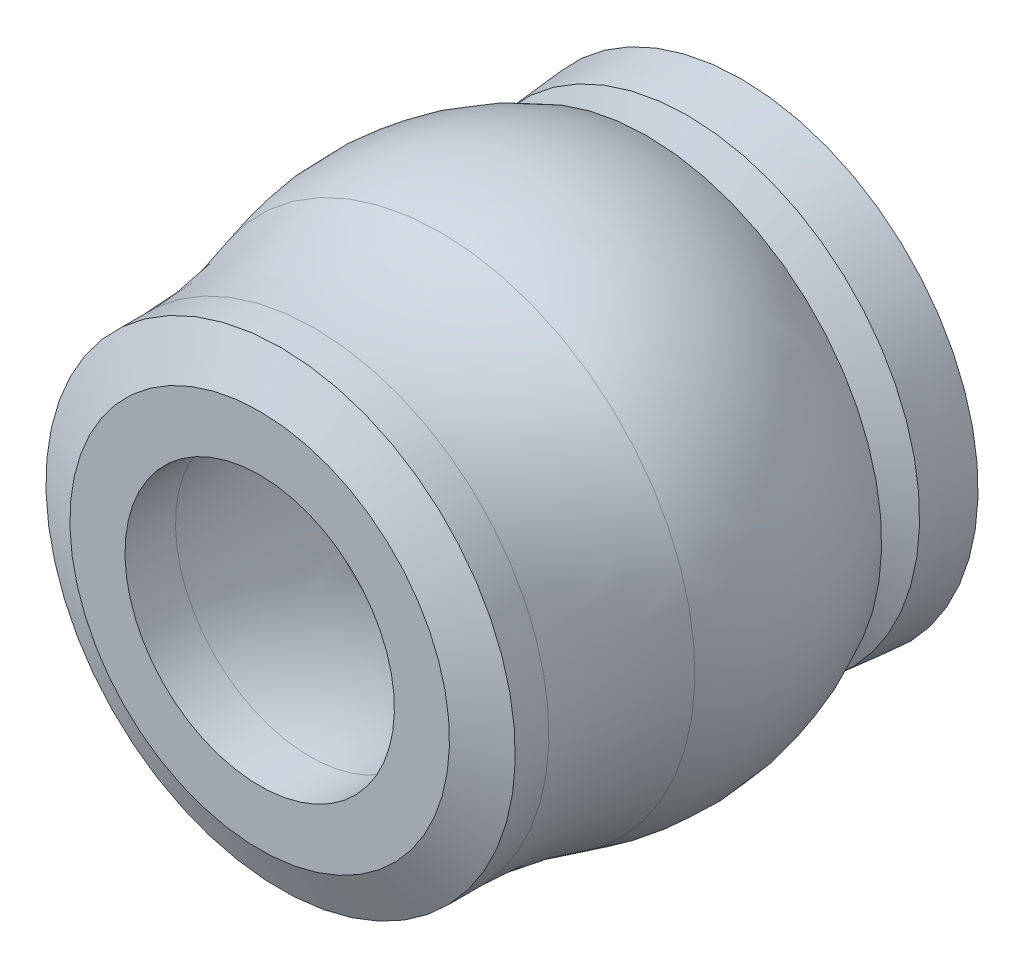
ISO-10303-21;
HEADER;
FILE_DESCRIPTION(('STEP AP214'),'2;1');
FILE_NAME('part.step','',(''),(''),'','','');
FILE_SCHEMA(('AUTOMOTIVE_DESIGN { 1 0 10303 214 1 1 1 1 }'));
ENDSEC;
DATA;
#1=APPLICATION_CONTEXT('core data for automotive mechanical design processes');
#2=APPLICATION_PROTOCOL_DEFINITION('international standard','automotive_design',2000,#1);
#3=PRODUCT_CONTEXT('',#1,'mechanical');
#4=PRODUCT('Part','Part','',(#3));
#5=PRODUCT_RELATED_PRODUCT_CATEGORY('part','',(#4));
#6=PRODUCT_DEFINITION_FORMATION('','',#4);
#7=PRODUCT_DEFINITION_CONTEXT('part definition',#1,'design');
#8=PRODUCT_DEFINITION('design','',#6,#7);
#9=PRODUCT_DEFINITION_SHAPE('','',#8);
#10=(LENGTH_UNIT() NAMED_UNIT(*) SI_UNIT(.MILLI.,.METRE.));
#11=(NAMED_UNIT(*) PLANE_ANGLE_UNIT() SI_UNIT($,.RADIAN.));
#12=(NAMED_UNIT(*) SI_UNIT($,.STERADIAN.) SOLID_ANGLE_UNIT());
#13=UNCERTAINTY_MEASURE_WITH_UNIT(LENGTH_MEASURE(1.E-05),#10,'distance_accuracy_value','');
#14=(GEOMETRIC_REPRESENTATION_CONTEXT(3) GLOBAL_UNCERTAINTY_ASSIGNED_CONTEXT((#13)) GLOBAL_UNIT_ASSIGNED_CONTEXT((#10,
#11,#12)) REPRESENTATION_CONTEXT('',''));
#15=CARTESIAN_POINT('',(0.,0.,0.));
#16=DIRECTION('',(0.,0.,1.));
#17=DIRECTION('',(1.,0.,0.));
#18=AXIS2_PLACEMENT_3D('',#15,#16,#17);
#19=CARTESIAN_POINT('',(0.,0.,7.0294771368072));
#20=DIRECTION('',(0.,0.,-1.));
#21=DIRECTION('',(0.,1.,0.));
#22=AXIS2_PLACEMENT_3D('',#19,#20,#21);
#23=TOROIDAL_SURFACE('',#22,9.398,1.016);
#24=CARTESIAN_POINT('',(0.,0.,7.0294771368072));
#25=DIRECTION('',(0.,0.,-1.));
#26=DIRECTION('',(0.,1.,0.));
#27=AXIS2_PLACEMENT_3D('',#24,#25,#26);
#28=CIRCLE('',#27,8.382);
#29=CARTESIAN_POINT('',(0.,8.382,7.0294771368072));
#30=VERTEX_POINT('',#29);
#31=EDGE_CURVE('E97',#30,#30,#28,.T.);
#32=ORIENTED_EDGE('',*,*,#31,.T.);
#33=EDGE_LOOP('',(#32));
#34=FACE_BOUND('',#33,.T.);
#35=CARTESIAN_POINT('',(0.,0.,7.62364055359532));
#36=DIRECTION('',(0.,0.,-1.));
#37=DIRECTION('',(0.,1.,0.));
#38=AXIS2_PLACEMENT_3D('',#35,#36,#37);
#39=CIRCLE('',#38,8.57384841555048);
#40=CARTESIAN_POINT('',(0.,8.57384841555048,7.62364055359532));
#41=VERTEX_POINT('',#40);
#42=EDGE_CURVE('E158',#41,#41,#39,.F.);
#43=ORIENTED_EDGE('',*,*,#42,.T.);
#44=EDGE_LOOP('',(#43));
#45=FACE_BOUND('',#44,.T.);
#46=ADVANCED_FACE('F12',(#34,#45),#23,.T.);
#47=CARTESIAN_POINT('',(0.,0.12326470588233,13.716));
#48=DIRECTION('',(1.,0.,0.));
#49=DIRECTION('',(0.,1.,0.));
#50=AXIS2_PLACEMENT_3D('',#47,#48,#49);
#51=CIRCLE('',#50,10.4177352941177);
#52=TRIMMED_CURVE('',#51,(PARAMETER_VALUE(-1.5826288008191)),(PARAMETER_VALUE(1.5826288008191)),
.T.,.PARAMETER.);
#53=CARTESIAN_POINT('',(0.,0.,13.716));
#54=DIRECTION('',(0.,0.,-1.));
#55=AXIS1_PLACEMENT('',#53,#54);
#56=SURFACE_OF_REVOLUTION('',#52,#55);
#57=ORIENTED_EDGE('',*,*,#42,.F.);
#58=EDGE_LOOP('',(#57));
#59=FACE_BOUND('',#58,.T.);
#60=CARTESIAN_POINT('',(0.,0.,17.0560762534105));
#61=DIRECTION('',(0.,0.,-1.));
#62=DIRECTION('',(0.,1.,0.));
#63=AXIS2_PLACEMENT_3D('',#60,#61,#62);
#64=CIRCLE('',#63,9.99104557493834);
#65=CARTESIAN_POINT('',(0.,9.99104557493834,17.0560762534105));
#66=VERTEX_POINT('',#65);
#67=EDGE_CURVE('E94',#66,#66,#64,.T.);
#68=ORIENTED_EDGE('',*,*,#67,.F.);
#69=EDGE_LOOP('',(#68));
#70=FACE_BOUND('',#69,.T.);
#71=ADVANCED_FACE('F101',(#59,#70),#56,.T.);
#72=CARTESIAN_POINT('',(0.,0.,-5.86541473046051));
#73=DIRECTION('',(0.,0.,-1.));
#74=DIRECTION('',(0.,1.,0.));
#75=AXIS2_PLACEMENT_3D('',#72,#73,#74);
#76=CYLINDRICAL_SURFACE('',#75,8.382);
#77=CARTESIAN_POINT('',(0.,0.,6.89873754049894));
#78=DIRECTION('',(0.,0.,1.));
#79=DIRECTION('',(0.,-1.,0.));
#80=AXIS2_PLACEMENT_3D('',#77,#78,#79);
#81=CIRCLE('',#80,8.382);
#82=CARTESIAN_POINT('',(0.,-8.382,6.89873754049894));
#83=VERTEX_POINT('',#82);
#84=EDGE_CURVE('E91',#83,#83,#81,.F.);
#85=ORIENTED_EDGE('',*,*,#84,.T.);
#86=EDGE_LOOP('',(#85));
#87=FACE_BOUND('',#86,.T.);
#88=ORIENTED_EDGE('',*,*,#31,.F.);
#89=EDGE_LOOP('',(#88));
#90=FACE_BOUND('',#89,.T.);
#91=ADVANCED_FACE('F84',(#87,#90),#76,.F.);
#92=CARTESIAN_POINT('',(0.,0.,26.8284040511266));
#93=DIRECTION('',(0.,0.,-1.));
#94=DIRECTION('',(0.,1.,0.));
#95=AXIS2_PLACEMENT_3D('',#92,#93,#94);
#96=TOROIDAL_SURFACE('',#95,38.862,30.48);
#97=ORIENTED_EDGE('',*,*,#67,.T.);
#98=EDGE_LOOP('',(#97));
#99=FACE_BOUND('',#98,.T.);
#100=CARTESIAN_POINT('',(0.,0.,26.8284040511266));
#101=DIRECTION('',(0.,0.,-1.));
#102=DIRECTION('',(0.,1.,0.));
#103=AXIS2_PLACEMENT_3D('',#100,#101,#102);
#104=CIRCLE('',#103,8.382);
#105=CARTESIAN_POINT('',(0.,8.382,26.8284040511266));
#106=VERTEX_POINT('',#105);
#107=EDGE_CURVE('E89',#106,#106,#104,.F.);
#108=ORIENTED_EDGE('',*,*,#107,.T.);
#109=EDGE_LOOP('',(#108));
#110=FACE_BOUND('',#109,.T.);
#111=ADVANCED_FACE('F79',(#99,#110),#96,.T.);
#112=CARTESIAN_POINT('',(0.,0.,6.89873754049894));
#113=DIRECTION('',(0.,0.,1.));
#114=DIRECTION('',(-1.,0.,0.));
#115=AXIS2_PLACEMENT_3D('',#112,#113,#114);
#116=CONICAL_SURFACE('',#115,8.382,1.13446401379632);
#117=ORIENTED_EDGE('',*,*,#84,.F.);
#118=EDGE_LOOP('',(#117));
#119=FACE_BOUND('',#118,.T.);
#120=CARTESIAN_POINT('',(0.,0.,4.826));
#121=DIRECTION('',(0.,0.,-1.));
#122=DIRECTION('',(0.,1.,0.));
#123=AXIS2_PLACEMENT_3D('',#120,#121,#122);
#124=CIRCLE('',#123,3.937);
#125=CARTESIAN_POINT('',(0.,3.937,4.826));
#126=VERTEX_POINT('',#125);
#127=EDGE_CURVE('E138',#126,#126,#124,.T.);
#128=ORIENTED_EDGE('',*,*,#127,.T.);
#129=EDGE_LOOP('',(#128));
#130=FACE_BOUND('',#129,.T.);
#131=ADVANCED_FACE('F75',(#119,#130),#116,.F.);
#132=CARTESIAN_POINT('',(0.,0.,-5.86541473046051));
#133=DIRECTION('',(0.,0.,-1.));
#134=DIRECTION('',(0.,1.,0.));
#135=AXIS2_PLACEMENT_3D('',#132,#133,#134);
#136=CYLINDRICAL_SURFACE('',#135,8.382);
#137=ORIENTED_EDGE('',*,*,#107,.F.);
#138=EDGE_LOOP('',(#137));
#139=FACE_BOUND('',#138,.T.);
#140=CARTESIAN_POINT('',(0.,0.,29.972));
#141=DIRECTION('',(0.,0.,-1.));
#142=DIRECTION('',(0.,1.,0.));
#143=AXIS2_PLACEMENT_3D('',#140,#141,#142);
#144=CIRCLE('',#143,8.382);
#145=CARTESIAN_POINT('',(0.,8.382,29.972));
#146=VERTEX_POINT('',#145);
#147=EDGE_CURVE('E16',#146,#146,#144,.T.);
#148=ORIENTED_EDGE('',*,*,#147,.F.);
#149=EDGE_LOOP('',(#148));
#150=FACE_BOUND('',#149,.T.);
#151=ADVANCED_FACE('F71',(#139,#150),#136,.F.);
#152=CARTESIAN_POINT('',(0.,0.,-5.86541473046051));
#153=DIRECTION('',(0.,0.,-1.));
#154=DIRECTION('',(0.,1.,0.));
#155=AXIS2_PLACEMENT_3D('',#152,#153,#154);
#156=CYLINDRICAL_SURFACE('',#155,3.937);
#157=CARTESIAN_POINT('',(0.,0.,0.));
#158=DIRECTION('',(0.,0.,-1.));
#159=DIRECTION('',(0.,1.,0.));
#160=AXIS2_PLACEMENT_3D('',#157,#158,#159);
#161=CIRCLE('',#160,3.937);
#162=CARTESIAN_POINT('',(0.,3.937,0.));
#163=VERTEX_POINT('',#162);
#164=EDGE_CURVE('E143',#163,#163,#161,.F.);
#165=ORIENTED_EDGE('',*,*,#164,.F.);
#166=EDGE_LOOP('',(#165));
#167=FACE_BOUND('',#166,.T.);
#168=ORIENTED_EDGE('',*,*,#127,.F.);
#169=EDGE_LOOP('',(#168));
#170=FACE_BOUND('',#169,.T.);
#171=ADVANCED_FACE('F67',(#167,#170),#156,.F.);
#172=CARTESIAN_POINT('',(11.811,0.,29.972));
#173=DIRECTION('',(0.,0.,1.));
#174=DIRECTION('',(0.,-1.,0.));
#175=AXIS2_PLACEMENT_3D('',#172,#173,#174);
#176=PLANE('',#175);
#177=CARTESIAN_POINT('',(0.,0.,29.972));
#178=DIRECTION('',(0.,0.,-1.));
#179=DIRECTION('',(0.,1.,0.));
#180=AXIS2_PLACEMENT_3D('',#177,#178,#179);
#181=CIRCLE('',#180,11.811);
#182=CARTESIAN_POINT('',(0.,11.811,29.972));
#183=VERTEX_POINT('',#182);
#184=EDGE_CURVE('E151',#183,#183,#181,.T.);
#185=ORIENTED_EDGE('',*,*,#184,.F.);
#186=EDGE_LOOP('',(#185));
#187=FACE_BOUND('',#186,.T.);
#188=ORIENTED_EDGE('',*,*,#147,.T.);
#189=EDGE_LOOP('',(#188));
#190=FACE_BOUND('',#189,.T.);
#191=ADVANCED_FACE('F63',(#187,#190),#176,.T.);
#192=CARTESIAN_POINT('',(3.937,0.,0.));
#193=DIRECTION('',(0.,0.,-1.));
#194=DIRECTION('',(0.,1.,0.));
#195=AXIS2_PLACEMENT_3D('',#192,#193,#194);
#196=PLANE('',#195);
#197=ORIENTED_EDGE('',*,*,#164,.T.);
#198=EDGE_LOOP('',(#197));
#199=FACE_BOUND('',#198,.T.);
#200=CARTESIAN_POINT('',(0.,0.,0.));
#201=DIRECTION('',(0.,0.,-1.));
#202=DIRECTION('',(0.,1.,0.));
#203=AXIS2_PLACEMENT_3D('',#200,#201,#202);
#204=CIRCLE('',#203,14.732);
#205=CARTESIAN_POINT('',(0.,14.732,0.));
#206=VERTEX_POINT('',#205);
#207=EDGE_CURVE('E136',#206,#206,#204,.F.);
#208=ORIENTED_EDGE('',*,*,#207,.F.);
#209=EDGE_LOOP('',(#208));
#210=FACE_BOUND('',#209,.T.);
#211=ADVANCED_FACE('F59',(#199,#210),#196,.T.);
#212=CARTESIAN_POINT('',(0.,0.,28.6691364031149));
#213=DIRECTION('',(0.,0.,-1.));
#214=DIRECTION('',(0.,1.,0.));
#215=AXIS2_PLACEMENT_3D('',#212,#213,#214);
#216=CONICAL_SURFACE('',#215,14.605,1.13446401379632);
#217=ORIENTED_EDGE('',*,*,#184,.T.);
#218=EDGE_LOOP('',(#217));
#219=FACE_BOUND('',#218,.T.);
#220=CARTESIAN_POINT('',(0.,0.,28.6691364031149));
#221=DIRECTION('',(0.,0.,-1.));
#222=DIRECTION('',(0.,1.,0.));
#223=AXIS2_PLACEMENT_3D('',#220,#221,#222);
#224=CIRCLE('',#223,14.605);
#225=CARTESIAN_POINT('',(0.,14.605,28.6691364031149));
#226=VERTEX_POINT('',#225);
#227=EDGE_CURVE('E133',#226,#226,#224,.T.);
#228=ORIENTED_EDGE('',*,*,#227,.F.);
#229=EDGE_LOOP('',(#228));
#230=FACE_BOUND('',#229,.T.);
#231=ADVANCED_FACE('F55',(#219,#230),#216,.T.);
#232=CARTESIAN_POINT('',(0.,0.,0.));
#233=DIRECTION('',(0.,0.,-1.));
#234=DIRECTION('',(0.,1.,0.));
#235=AXIS2_PLACEMENT_3D('',#232,#233,#234);
#236=CONICAL_SURFACE('',#235,14.732,0.0872664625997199);
#237=CARTESIAN_POINT('',(0.,0.,3.34643876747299));
#238=DIRECTION('',(0.,0.,-1.));
#239=DIRECTION('',(0.,1.,0.));
#240=AXIS2_PLACEMENT_3D('',#237,#238,#239);
#241=CIRCLE('',#240,14.4392245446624);
#242=CARTESIAN_POINT('',(0.,14.4392245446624,3.34643876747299));
#243=VERTEX_POINT('',#242);
#244=EDGE_CURVE('E132',#243,#243,#241,.F.);
#245=ORIENTED_EDGE('',*,*,#244,.F.);
#246=EDGE_LOOP('',(#245));
#247=FACE_BOUND('',#246,.T.);
#248=ORIENTED_EDGE('',*,*,#207,.T.);
#249=EDGE_LOOP('',(#248));
#250=FACE_BOUND('',#249,.T.);
#251=ADVANCED_FACE('F51',(#247,#250),#236,.T.);
#252=CARTESIAN_POINT('',(0.,0.,-5.86541473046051));
#253=DIRECTION('',(0.,0.,-1.));
#254=DIRECTION('',(0.,1.,0.));
#255=AXIS2_PLACEMENT_3D('',#252,#253,#254);
#256=CYLINDRICAL_SURFACE('',#255,14.605);
#257=ORIENTED_EDGE('',*,*,#227,.T.);
#258=EDGE_LOOP('',(#257));
#259=FACE_BOUND('',#258,.T.);
#260=CARTESIAN_POINT('',(0.,0.,26.5763789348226));
#261=DIRECTION('',(0.,0.,-1.));
#262=DIRECTION('',(0.,1.,0.));
#263=AXIS2_PLACEMENT_3D('',#260,#261,#262);
#264=CIRCLE('',#263,14.605);
#265=CARTESIAN_POINT('',(0.,14.605,26.5763789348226));
#266=VERTEX_POINT('',#265);
#267=EDGE_CURVE('E32',#266,#266,#264,.F.);
#268=ORIENTED_EDGE('',*,*,#267,.T.);
#269=EDGE_LOOP('',(#268));
#270=FACE_BOUND('',#269,.T.);
#271=ADVANCED_FACE('F47',(#259,#270),#256,.T.);
#272=CARTESIAN_POINT('',(0.,0.,3.34643876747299));
#273=DIRECTION('',(0.,0.,-1.));
#274=DIRECTION('',(0.,1.,0.));
#275=AXIS2_PLACEMENT_3D('',#272,#273,#274);
#276=CONICAL_SURFACE('',#275,14.4392245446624,1.13446401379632);
#277=CARTESIAN_POINT('',(0.,0.,4.572));
#278=DIRECTION('',(0.,0.,1.));
#279=DIRECTION('',(0.,-1.,0.));
#280=AXIS2_PLACEMENT_3D('',#277,#278,#279);
#281=CIRCLE('',#280,11.811);
#282=CARTESIAN_POINT('',(0.,-11.811,4.572));
#283=VERTEX_POINT('',#282);
#284=EDGE_CURVE('E25',#283,#283,#281,.T.);
#285=ORIENTED_EDGE('',*,*,#284,.F.);
#286=EDGE_LOOP('',(#285));
#287=FACE_BOUND('',#286,.T.);
#288=ORIENTED_EDGE('',*,*,#244,.T.);
#289=EDGE_LOOP('',(#288));
#290=FACE_BOUND('',#289,.T.);
#291=ADVANCED_FACE('F42',(#287,#290),#276,.T.);
#292=CARTESIAN_POINT('',(0.,0.,26.5763789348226));
#293=DIRECTION('',(0.,0.,-1.));
#294=DIRECTION('',(0.,1.,0.));
#295=AXIS2_PLACEMENT_3D('',#292,#293,#294);
#296=TOROIDAL_SURFACE('',#295,40.005,25.4);
#297=ORIENTED_EDGE('',*,*,#267,.F.);
#298=EDGE_LOOP('',(#297));
#299=FACE_BOUND('',#298,.T.);
#300=CARTESIAN_POINT('',(0.,0.,18.7357195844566));
#301=DIRECTION('',(0.,0.,-1.));
#302=DIRECTION('',(0.,1.,0.));
#303=AXIS2_PLACEMENT_3D('',#300,#301,#302);
#304=CIRCLE('',#303,15.845445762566);
#305=CARTESIAN_POINT('',(0.,15.845445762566,18.7357195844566));
#306=VERTEX_POINT('',#305);
#307=EDGE_CURVE('E20',#306,#306,#304,.T.);
#308=ORIENTED_EDGE('',*,*,#307,.F.);
#309=EDGE_LOOP('',(#308));
#310=FACE_BOUND('',#309,.T.);
#311=ADVANCED_FACE('F37',(#299,#310),#296,.F.);
#312=CARTESIAN_POINT('',(0.,0.,5.87486359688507));
#313=DIRECTION('',(0.,0.,1.));
#314=DIRECTION('',(0.,-1.,0.));
#315=AXIS2_PLACEMENT_3D('',#312,#313,#314);
#316=CONICAL_SURFACE('',#315,14.605,1.13446401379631);
#317=ORIENTED_EDGE('',*,*,#284,.T.);
#318=EDGE_LOOP('',(#317));
#319=FACE_BOUND('',#318,.T.);
#320=CARTESIAN_POINT('',(0.,0.,5.87486359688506));
#321=DIRECTION('',(0.,0.,-1.));
#322=DIRECTION('',(0.,1.,0.));
#323=AXIS2_PLACEMENT_3D('',#320,#321,#322);
#324=CIRCLE('',#323,14.605);
#325=CARTESIAN_POINT('',(0.,14.605,5.87486359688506));
#326=VERTEX_POINT('',#325);
#327=EDGE_CURVE('E8',#326,#326,#324,.F.);
#328=ORIENTED_EDGE('',*,*,#327,.F.);
#329=EDGE_LOOP('',(#328));
#330=FACE_BOUND('',#329,.T.);
#331=ADVANCED_FACE('F41',(#319,#330),#316,.T.);
#332=CARTESIAN_POINT('',(0.,0.428731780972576,13.7324317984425));
#333=DIRECTION('',(1.,0.,0.));
#334=DIRECTION('',(0.,1.,0.));
#335=AXIS2_PLACEMENT_3D('',#332,#333,#334);
#336=CIRCLE('',#335,16.2082682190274);
#337=TRIMMED_CURVE('',#336,(PARAMETER_VALUE(-1.5972508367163)),
(PARAMETER_VALUE(1.5972508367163)),.T.,.PARAMETER.);
#338=CARTESIAN_POINT('',(0.,0.,13.7324317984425));
#339=DIRECTION('',(0.,0.,-1.));
#340=AXIS1_PLACEMENT('',#338,#339);
#341=SURFACE_OF_REVOLUTION('',#337,#340);
#342=ORIENTED_EDGE('',*,*,#307,.T.);
#343=EDGE_LOOP('',(#342));
#344=FACE_BOUND('',#343,.T.);
#345=ORIENTED_EDGE('',*,*,#327,.T.);
#346=EDGE_LOOP('',(#345));
#347=FACE_BOUND('',#346,.T.);
#348=ADVANCED_FACE('F114',(#344,#347),#341,.F.);
#349=CLOSED_SHELL('',(#46,#71,#91,#111,#131,#151,#171,#191,#211,#231,#251,#271,#291,#311,#331,#348));
#350=MANIFOLD_SOLID_BREP('B1',#349);
#351=ADVANCED_BREP_SHAPE_REPRESENTATION('',(#18,#350),#14);
#352=SHAPE_DEFINITION_REPRESENTATION(#9,#351);
ENDSEC;
END-ISO-10303-21;
